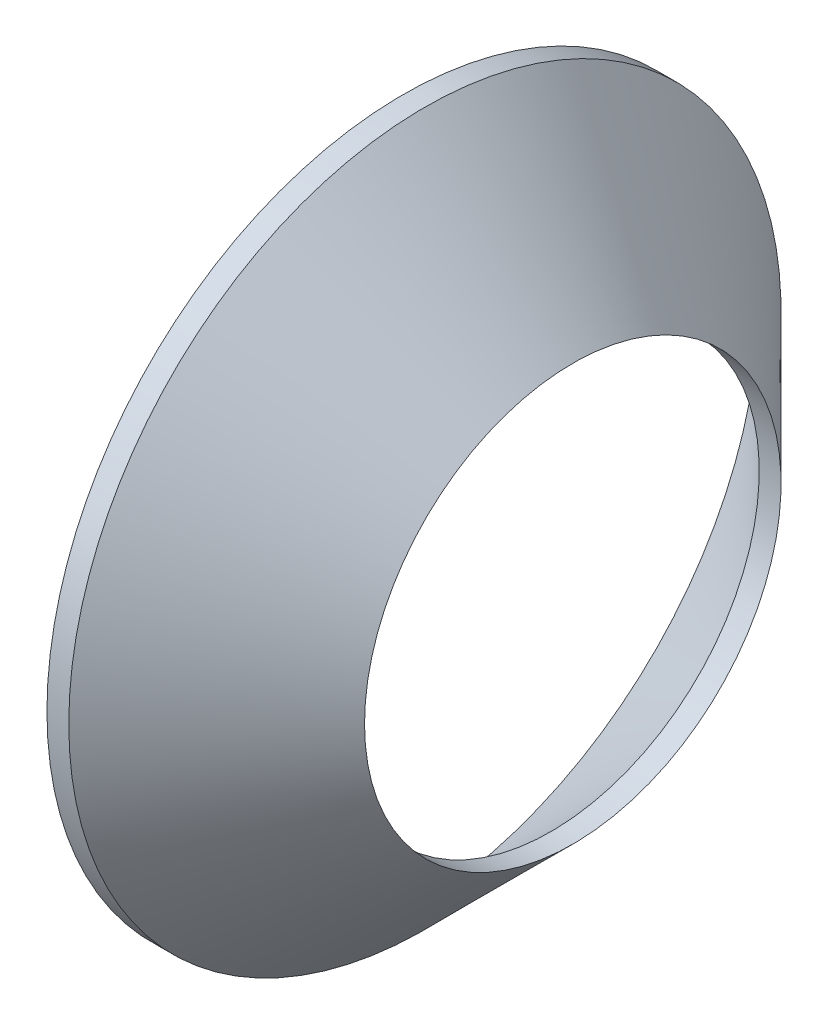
ISO-10303-21;
HEADER;
FILE_DESCRIPTION(('STEP AP214'),'2;1');
FILE_NAME('part.step','',(''),(''),'','','');
FILE_SCHEMA(('AUTOMOTIVE_DESIGN { 1 0 10303 214 1 1 1 1 }'));
ENDSEC;
DATA;
#1=APPLICATION_CONTEXT('core data for automotive mechanical design processes');
#2=APPLICATION_PROTOCOL_DEFINITION('international standard','automotive_design',2000,#1);
#3=PRODUCT_CONTEXT('',#1,'mechanical');
#4=PRODUCT('Part','Part','',(#3));
#5=PRODUCT_RELATED_PRODUCT_CATEGORY('part','',(#4));
#6=PRODUCT_DEFINITION_FORMATION('','',#4);
#7=PRODUCT_DEFINITION_CONTEXT('part definition',#1,'design');
#8=PRODUCT_DEFINITION('design','',#6,#7);
#9=PRODUCT_DEFINITION_SHAPE('','',#8);
#10=(LENGTH_UNIT() NAMED_UNIT(*) SI_UNIT(.MILLI.,.METRE.));
#11=(NAMED_UNIT(*) PLANE_ANGLE_UNIT() SI_UNIT($,.RADIAN.));
#12=(NAMED_UNIT(*) SI_UNIT($,.STERADIAN.) SOLID_ANGLE_UNIT());
#13=UNCERTAINTY_MEASURE_WITH_UNIT(LENGTH_MEASURE(1.E-05),#10,'distance_accuracy_value','');
#14=(GEOMETRIC_REPRESENTATION_CONTEXT(3) GLOBAL_UNCERTAINTY_ASSIGNED_CONTEXT((#13)) GLOBAL_UNIT_ASSIGNED_CONTEXT((#10,
#11,#12)) REPRESENTATION_CONTEXT('',''));
#15=CARTESIAN_POINT('',(0.,0.,0.));
#16=DIRECTION('',(0.,0.,1.));
#17=DIRECTION('',(1.,0.,0.));
#18=AXIS2_PLACEMENT_3D('',#15,#16,#17);
#19=CARTESIAN_POINT('',(0.,0.,0.));
#20=DIRECTION('',(-1.,0.,0.));
#21=DIRECTION('',(0.,0.,1.));
#22=AXIS2_PLACEMENT_3D('',#19,#20,#21);
#23=CONICAL_SURFACE('',#22,11.5428932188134,0.785398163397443);
#24=CARTESIAN_POINT('',(4.79289321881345,0.,0.));
#25=DIRECTION('',(-1.,0.,0.));
#26=DIRECTION('',(0.,0.,1.));
#27=AXIS2_PLACEMENT_3D('',#24,#25,#26);
#28=CIRCLE('',#27,6.75);
#29=CARTESIAN_POINT('',(4.79289321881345,0.,6.75));
#30=VERTEX_POINT('',#29);
#31=EDGE_CURVE('E10',#30,#30,#28,.T.);
#32=ORIENTED_EDGE('',*,*,#31,.F.);
#33=EDGE_LOOP('',(#32));
#34=FACE_BOUND('',#33,.T.);
#35=CARTESIAN_POINT('',(0.,0.,0.));
#36=DIRECTION('',(-1.,0.,0.));
#37=DIRECTION('',(0.,0.,1.));
#38=AXIS2_PLACEMENT_3D('',#35,#36,#37);
#39=CIRCLE('',#38,11.5428932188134);
#40=CARTESIAN_POINT('',(0.,0.,11.5428932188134));
#41=VERTEX_POINT('',#40);
#42=EDGE_CURVE('E48',#41,#41,#39,.T.);
#43=ORIENTED_EDGE('',*,*,#42,.T.);
#44=EDGE_LOOP('',(#43));
#45=FACE_BOUND('',#44,.T.);
#46=ADVANCED_FACE('F34',(#34,#45),#23,.F.);
#47=CARTESIAN_POINT('',(0.,0.,0.));
#48=DIRECTION('',(-1.,0.,0.));
#49=DIRECTION('',(0.,0.,1.));
#50=AXIS2_PLACEMENT_3D('',#47,#48,#49);
#51=CYLINDRICAL_SURFACE('',#50,6.75);
#52=CARTESIAN_POINT('',(5.5,0.,0.));
#53=DIRECTION('',(-1.,0.,0.));
#54=DIRECTION('',(0.,0.,1.));
#55=AXIS2_PLACEMENT_3D('',#52,#53,#54);
#56=CIRCLE('',#55,6.75);
#57=CARTESIAN_POINT('',(5.5,0.,6.75));
#58=VERTEX_POINT('',#57);
#59=EDGE_CURVE('E40',#58,#58,#56,.T.);
#60=ORIENTED_EDGE('',*,*,#59,.F.);
#61=EDGE_LOOP('',(#60));
#62=FACE_BOUND('',#61,.T.);
#63=ORIENTED_EDGE('',*,*,#31,.T.);
#64=EDGE_LOOP('',(#63));
#65=FACE_BOUND('',#64,.T.);
#66=ADVANCED_FACE('F63',(#62,#65),#51,.F.);
#67=CARTESIAN_POINT('',(5.5,0.,0.));
#68=DIRECTION('',(-1.,0.,0.));
#69=DIRECTION('',(0.,0.,1.));
#70=AXIS2_PLACEMENT_3D('',#67,#68,#69);
#71=CONICAL_SURFACE('',#70,6.75,0.785398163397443);
#72=CARTESIAN_POINT('',(0.707106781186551,0.,0.));
#73=DIRECTION('',(-1.,0.,0.));
#74=DIRECTION('',(0.,0.,1.));
#75=AXIS2_PLACEMENT_3D('',#72,#73,#74);
#76=CIRCLE('',#75,11.5428932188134);
#77=CARTESIAN_POINT('',(0.707106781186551,0.,11.5428932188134));
#78=VERTEX_POINT('',#77);
#79=EDGE_CURVE('E44',#78,#78,#76,.T.);
#80=ORIENTED_EDGE('',*,*,#79,.F.);
#81=EDGE_LOOP('',(#80));
#82=FACE_BOUND('',#81,.T.);
#83=ORIENTED_EDGE('',*,*,#59,.T.);
#84=EDGE_LOOP('',(#83));
#85=FACE_BOUND('',#84,.T.);
#86=ADVANCED_FACE('F58',(#82,#85),#71,.T.);
#87=CARTESIAN_POINT('',(0.,0.,0.));
#88=DIRECTION('',(-1.,0.,0.));
#89=DIRECTION('',(0.,0.,1.));
#90=AXIS2_PLACEMENT_3D('',#87,#88,#89);
#91=CYLINDRICAL_SURFACE('',#90,11.5428932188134);
#92=ORIENTED_EDGE('',*,*,#42,.F.);
#93=EDGE_LOOP('',(#92));
#94=FACE_BOUND('',#93,.T.);
#95=ORIENTED_EDGE('',*,*,#79,.T.);
#96=EDGE_LOOP('',(#95));
#97=FACE_BOUND('',#96,.T.);
#98=ADVANCED_FACE('F55',(#94,#97),#91,.T.);
#99=CLOSED_SHELL('',(#46,#66,#86,#98));
#100=MANIFOLD_SOLID_BREP('B2',#99);
#101=ADVANCED_BREP_SHAPE_REPRESENTATION('',(#18,#100),#14);
#102=SHAPE_DEFINITION_REPRESENTATION(#9,#101);
ENDSEC;
END-ISO-10303-21;
